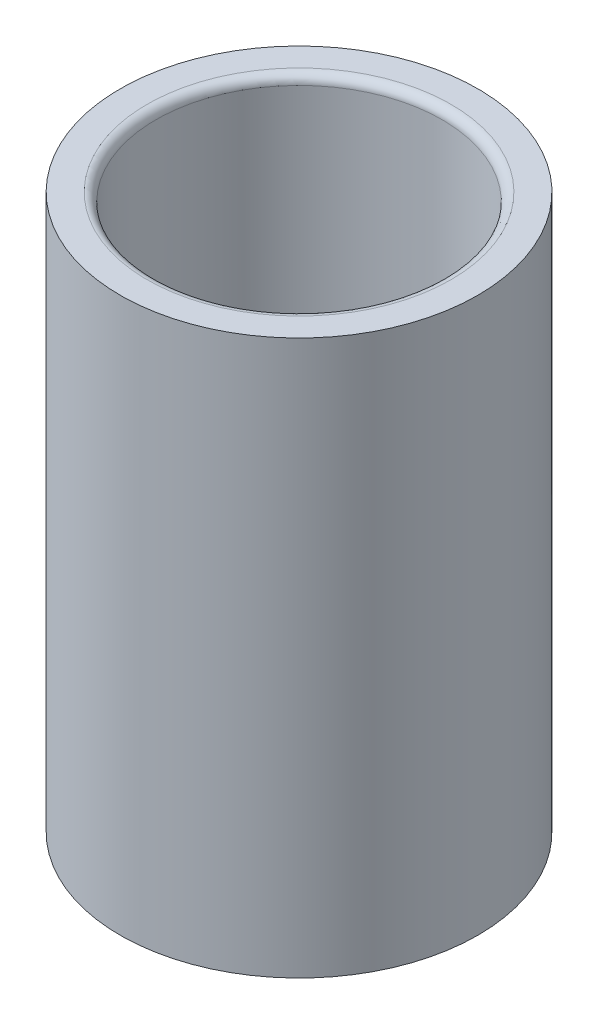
from build123d import *

# Parameters (mm, degrees)
SKETCH1_W     = 6.35
SKETCH1_H     = 98.425
FILLET1_R     = 1.5748
CHAMFER1_SIZE = 1.524


with BuildPart() as part:
    # Sketch1 → Revolve1 (revolve)
    with BuildSketch(Plane.XY, mode=Mode.PRIVATE) as revolve1_sk:
        with Locations((-28.58135, 49.2125)):
            Rectangle(SKETCH1_W, SKETCH1_H)
    revolve(revolve1_sk.sketch.rotate(Axis((0, -1000, 0), (0, 1, 0)), 180), axis=Axis((0, -1000, 0), (0, 1, 0)))

    # Fillet1
    fillet1_edges = [part.edges().sort_by_distance(p)[0] for p in [
        (-25.40635, 98.425, 0),
    ]]
    fillet(fillet1_edges, radius=FILLET1_R)

    # Chamfer1
    chamfer1_edges = [part.edges().sort_by_distance(p)[0] for p in [
        (-25.40635, 0, 0),
    ]]
    chamfer(chamfer1_edges, length=CHAMFER1_SIZE)


solid = part.part
